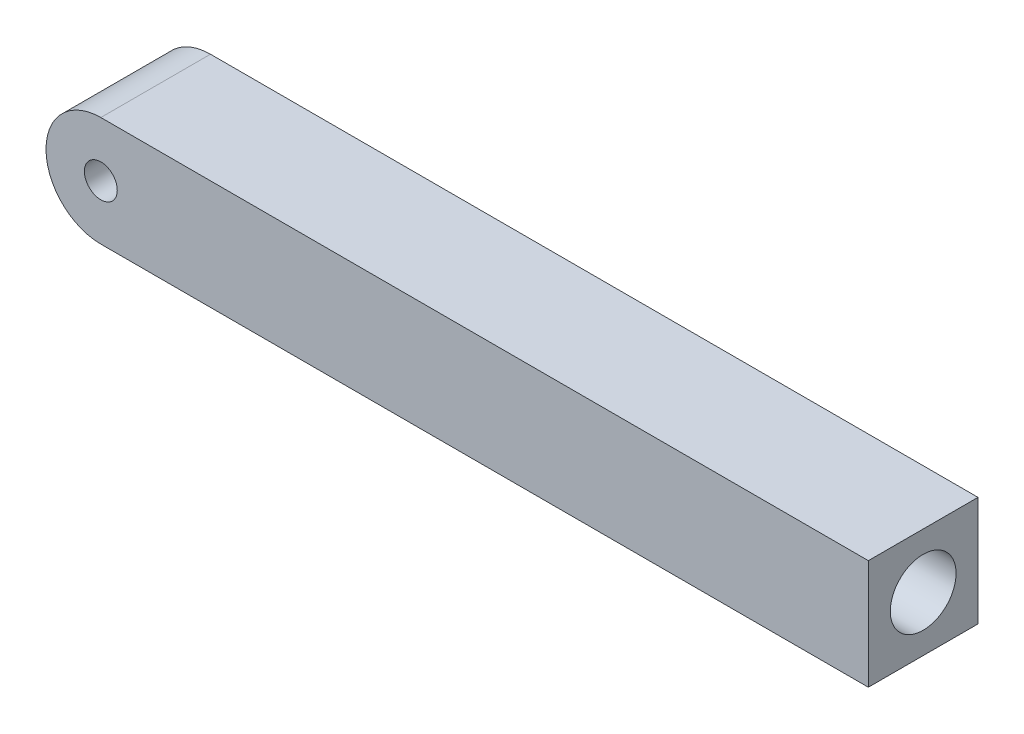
ISO-10303-21;
HEADER;
FILE_DESCRIPTION(('STEP AP214'),'2;1');
FILE_NAME('part.step','',(''),(''),'','','');
FILE_SCHEMA(('AUTOMOTIVE_DESIGN { 1 0 10303 214 1 1 1 1 }'));
ENDSEC;
DATA;
#1=APPLICATION_CONTEXT('core data for automotive mechanical design processes');
#2=APPLICATION_PROTOCOL_DEFINITION('international standard','automotive_design',2000,#1);
#3=PRODUCT_CONTEXT('',#1,'mechanical');
#4=PRODUCT('Part','Part','',(#3));
#5=PRODUCT_RELATED_PRODUCT_CATEGORY('part','',(#4));
#6=PRODUCT_DEFINITION_FORMATION('','',#4);
#7=PRODUCT_DEFINITION_CONTEXT('part definition',#1,'design');
#8=PRODUCT_DEFINITION('design','',#6,#7);
#9=PRODUCT_DEFINITION_SHAPE('','',#8);
#10=(LENGTH_UNIT() NAMED_UNIT(*) SI_UNIT(.MILLI.,.METRE.));
#11=(NAMED_UNIT(*) PLANE_ANGLE_UNIT() SI_UNIT($,.RADIAN.));
#12=(NAMED_UNIT(*) SI_UNIT($,.STERADIAN.) SOLID_ANGLE_UNIT());
#13=UNCERTAINTY_MEASURE_WITH_UNIT(LENGTH_MEASURE(1.E-05),#10,'distance_accuracy_value','');
#14=(GEOMETRIC_REPRESENTATION_CONTEXT(3) GLOBAL_UNCERTAINTY_ASSIGNED_CONTEXT((#13)) GLOBAL_UNIT_ASSIGNED_CONTEXT((#10,
#11,#12)) REPRESENTATION_CONTEXT('',''));
#15=CARTESIAN_POINT('',(0.,0.,0.));
#16=DIRECTION('',(0.,0.,1.));
#17=DIRECTION('',(1.,0.,0.));
#18=AXIS2_PLACEMENT_3D('',#15,#16,#17);
#19=CARTESIAN_POINT('',(0.,0.,5.));
#20=DIRECTION('',(0.,0.,1.));
#21=DIRECTION('',(1.,0.,0.));
#22=AXIS2_PLACEMENT_3D('',#19,#20,#21);
#23=PLANE('',#22);
#24=DIRECTION('',(0.,1.,0.));
#25=VECTOR('',#24,1.);
#26=CARTESIAN_POINT('',(35.,2.5,5.));
#27=LINE('',#26,#25);
#28=CARTESIAN_POINT('',(35.,-2.5,5.));
#29=VERTEX_POINT('',#28);
#30=CARTESIAN_POINT('',(35.,2.5,5.));
#31=VERTEX_POINT('',#30);
#32=EDGE_CURVE('E100',#29,#31,#27,.T.);
#33=ORIENTED_EDGE('',*,*,#32,.T.);
#34=DIRECTION('',(-1.,0.,0.));
#35=VECTOR('',#34,1.);
#36=CARTESIAN_POINT('',(0.,2.5,5.));
#37=LINE('',#36,#35);
#38=CARTESIAN_POINT('',(0.,2.5,5.));
#39=VERTEX_POINT('',#38);
#40=EDGE_CURVE('E85',#31,#39,#37,.T.);
#41=ORIENTED_EDGE('',*,*,#40,.T.);
#42=CARTESIAN_POINT('',(0.,0.,5.));
#43=DIRECTION('',(0.,0.,1.));
#44=DIRECTION('',(1.,0.,0.));
#45=AXIS2_PLACEMENT_3D('',#42,#43,#44);
#46=CIRCLE('',#45,2.5);
#47=CARTESIAN_POINT('',(0.,-2.5,5.));
#48=VERTEX_POINT('',#47);
#49=EDGE_CURVE('E51',#39,#48,#46,.T.);
#50=ORIENTED_EDGE('',*,*,#49,.T.);
#51=DIRECTION('',(1.,0.,0.));
#52=VECTOR('',#51,1.);
#53=CARTESIAN_POINT('',(0.,-2.5,5.));
#54=LINE('',#53,#52);
#55=EDGE_CURVE('E46',#48,#29,#54,.T.);
#56=ORIENTED_EDGE('',*,*,#55,.T.);
#57=EDGE_LOOP('',(#33,#41,#50,#56));
#58=FACE_BOUND('',#57,.T.);
#59=CARTESIAN_POINT('',(0.,0.,5.));
#60=DIRECTION('',(0.,0.,1.));
#61=DIRECTION('',(1.,0.,0.));
#62=AXIS2_PLACEMENT_3D('',#59,#60,#61);
#63=CIRCLE('',#62,0.75);
#64=CARTESIAN_POINT('',(0.75,0.,5.));
#65=VERTEX_POINT('',#64);
#66=EDGE_CURVE('E90',#65,#65,#63,.T.);
#67=ORIENTED_EDGE('',*,*,#66,.F.);
#68=EDGE_LOOP('',(#67));
#69=FACE_BOUND('',#68,.T.);
#70=ADVANCED_FACE('F31',(#58,#69),#23,.T.);
#71=CARTESIAN_POINT('',(0.,0.,0.));
#72=DIRECTION('',(0.,0.,1.));
#73=DIRECTION('',(1.,0.,0.));
#74=AXIS2_PLACEMENT_3D('',#71,#72,#73);
#75=PLANE('',#74);
#76=DIRECTION('',(0.,1.,0.));
#77=VECTOR('',#76,1.);
#78=CARTESIAN_POINT('',(35.,2.5,0.));
#79=LINE('',#78,#77);
#80=CARTESIAN_POINT('',(35.,-2.5,0.));
#81=VERTEX_POINT('',#80);
#82=CARTESIAN_POINT('',(35.,2.5,0.));
#83=VERTEX_POINT('',#82);
#84=EDGE_CURVE('E77',#81,#83,#79,.T.);
#85=ORIENTED_EDGE('',*,*,#84,.F.);
#86=DIRECTION('',(1.,0.,0.));
#87=VECTOR('',#86,1.);
#88=CARTESIAN_POINT('',(0.,-2.5,0.));
#89=LINE('',#88,#87);
#90=CARTESIAN_POINT('',(0.,-2.5,0.));
#91=VERTEX_POINT('',#90);
#92=EDGE_CURVE('E98',#91,#81,#89,.T.);
#93=ORIENTED_EDGE('',*,*,#92,.F.);
#94=CARTESIAN_POINT('',(0.,0.,0.));
#95=DIRECTION('',(0.,0.,1.));
#96=DIRECTION('',(1.,0.,0.));
#97=AXIS2_PLACEMENT_3D('',#94,#95,#96);
#98=CIRCLE('',#97,2.5);
#99=CARTESIAN_POINT('',(0.,2.5,0.));
#100=VERTEX_POINT('',#99);
#101=EDGE_CURVE('E78',#100,#91,#98,.T.);
#102=ORIENTED_EDGE('',*,*,#101,.F.);
#103=DIRECTION('',(-1.,0.,0.));
#104=VECTOR('',#103,1.);
#105=CARTESIAN_POINT('',(0.,2.5,0.));
#106=LINE('',#105,#104);
#107=EDGE_CURVE('E72',#83,#100,#106,.T.);
#108=ORIENTED_EDGE('',*,*,#107,.F.);
#109=EDGE_LOOP('',(#85,#93,#102,#108));
#110=FACE_BOUND('',#109,.T.);
#111=CARTESIAN_POINT('',(0.,0.,0.));
#112=DIRECTION('',(0.,0.,1.));
#113=DIRECTION('',(1.,0.,0.));
#114=AXIS2_PLACEMENT_3D('',#111,#112,#113);
#115=CIRCLE('',#114,0.75);
#116=CARTESIAN_POINT('',(0.75,0.,0.));
#117=VERTEX_POINT('',#116);
#118=EDGE_CURVE('E93',#117,#117,#115,.T.);
#119=ORIENTED_EDGE('',*,*,#118,.T.);
#120=EDGE_LOOP('',(#119));
#121=FACE_BOUND('',#120,.T.);
#122=ADVANCED_FACE('F73',(#110,#121),#75,.F.);
#123=CARTESIAN_POINT('',(35.,2.5,5.));
#124=DIRECTION('',(-1.,0.,0.));
#125=DIRECTION('',(0.,-1.,0.));
#126=AXIS2_PLACEMENT_3D('',#123,#124,#125);
#127=PLANE('',#126);
#128=CARTESIAN_POINT('',(35.,0.,2.5));
#129=DIRECTION('',(1.,0.,0.));
#130=DIRECTION('',(0.,1.,0.));
#131=AXIS2_PLACEMENT_3D('',#128,#129,#130);
#132=CIRCLE('',#131,1.5);
#133=CARTESIAN_POINT('',(35.,1.5000000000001,2.5));
#134=VERTEX_POINT('',#133);
#135=EDGE_CURVE('E126',#134,#134,#132,.T.);
#136=ORIENTED_EDGE('',*,*,#135,.F.);
#137=EDGE_LOOP('',(#136));
#138=FACE_BOUND('',#137,.T.);
#139=ORIENTED_EDGE('',*,*,#84,.T.);
#140=DIRECTION('',(0.,0.,-1.));
#141=VECTOR('',#140,1.);
#142=CARTESIAN_POINT('',(35.,2.5,5.));
#143=LINE('',#142,#141);
#144=EDGE_CURVE('E11',#31,#83,#143,.T.);
#145=ORIENTED_EDGE('',*,*,#144,.F.);
#146=ORIENTED_EDGE('',*,*,#32,.F.);
#147=DIRECTION('',(0.,0.,-1.));
#148=VECTOR('',#147,1.);
#149=CARTESIAN_POINT('',(35.,-2.5,5.));
#150=LINE('',#149,#148);
#151=EDGE_CURVE('E89',#29,#81,#150,.T.);
#152=ORIENTED_EDGE('',*,*,#151,.T.);
#153=EDGE_LOOP('',(#139,#145,#146,#152));
#154=FACE_BOUND('',#153,.T.);
#155=ADVANCED_FACE('F33',(#138,#154),#127,.F.);
#156=CARTESIAN_POINT('',(0.,2.5,5.));
#157=DIRECTION('',(0.,-1.,0.));
#158=DIRECTION('',(0.,0.,-1.));
#159=AXIS2_PLACEMENT_3D('',#156,#157,#158);
#160=PLANE('',#159);
#161=ORIENTED_EDGE('',*,*,#107,.T.);
#162=DIRECTION('',(0.,0.,-1.));
#163=VECTOR('',#162,1.);
#164=CARTESIAN_POINT('',(0.,2.5,5.));
#165=LINE('',#164,#163);
#166=EDGE_CURVE('E39',#39,#100,#165,.T.);
#167=ORIENTED_EDGE('',*,*,#166,.F.);
#168=ORIENTED_EDGE('',*,*,#40,.F.);
#169=ORIENTED_EDGE('',*,*,#144,.T.);
#170=EDGE_LOOP('',(#161,#167,#168,#169));
#171=FACE_BOUND('',#170,.T.);
#172=ADVANCED_FACE('F84',(#171),#160,.F.);
#173=CARTESIAN_POINT('',(0.,0.,5.));
#174=DIRECTION('',(0.,0.,-1.));
#175=DIRECTION('',(-1.,0.,0.));
#176=AXIS2_PLACEMENT_3D('',#173,#174,#175);
#177=CYLINDRICAL_SURFACE('',#176,2.5);
#178=ORIENTED_EDGE('',*,*,#101,.T.);
#179=DIRECTION('',(0.,0.,-1.));
#180=VECTOR('',#179,1.);
#181=CARTESIAN_POINT('',(0.,-2.5,5.));
#182=LINE('',#181,#180);
#183=EDGE_CURVE('E106',#48,#91,#182,.T.);
#184=ORIENTED_EDGE('',*,*,#183,.F.);
#185=ORIENTED_EDGE('',*,*,#49,.F.);
#186=ORIENTED_EDGE('',*,*,#166,.T.);
#187=EDGE_LOOP('',(#178,#184,#185,#186));
#188=FACE_BOUND('',#187,.T.);
#189=ADVANCED_FACE('F109',(#188),#177,.T.);
#190=CARTESIAN_POINT('',(0.,-2.5,5.));
#191=DIRECTION('',(0.,1.,0.));
#192=DIRECTION('',(0.,0.,1.));
#193=AXIS2_PLACEMENT_3D('',#190,#191,#192);
#194=PLANE('',#193);
#195=ORIENTED_EDGE('',*,*,#92,.T.);
#196=ORIENTED_EDGE('',*,*,#151,.F.);
#197=ORIENTED_EDGE('',*,*,#55,.F.);
#198=ORIENTED_EDGE('',*,*,#183,.T.);
#199=EDGE_LOOP('',(#195,#196,#197,#198));
#200=FACE_BOUND('',#199,.T.);
#201=ADVANCED_FACE('F111',(#200),#194,.F.);
#202=CARTESIAN_POINT('',(0.,0.,5.));
#203=DIRECTION('',(0.,0.,-1.));
#204=DIRECTION('',(-1.,0.,0.));
#205=AXIS2_PLACEMENT_3D('',#202,#203,#204);
#206=CYLINDRICAL_SURFACE('',#205,0.75);
#207=ORIENTED_EDGE('',*,*,#66,.T.);
#208=EDGE_LOOP('',(#207));
#209=FACE_BOUND('',#208,.T.);
#210=ORIENTED_EDGE('',*,*,#118,.F.);
#211=EDGE_LOOP('',(#210));
#212=FACE_BOUND('',#211,.T.);
#213=ADVANCED_FACE('F117',(#209,#212),#206,.F.);
#214=CARTESIAN_POINT('',(15.,0.,2.5));
#215=DIRECTION('',(1.,0.,0.));
#216=DIRECTION('',(0.,1.,0.));
#217=AXIS2_PLACEMENT_3D('',#214,#215,#216);
#218=CYLINDRICAL_SURFACE('',#217,1.5);
#219=CARTESIAN_POINT('',(15.,0.,2.5));
#220=DIRECTION('',(1.,0.,0.));
#221=DIRECTION('',(0.,1.,0.));
#222=AXIS2_PLACEMENT_3D('',#219,#220,#221);
#223=CIRCLE('',#222,1.5);
#224=CARTESIAN_POINT('',(15.,1.50000000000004,2.5));
#225=VERTEX_POINT('',#224);
#226=EDGE_CURVE('E124',#225,#225,#223,.T.);
#227=ORIENTED_EDGE('',*,*,#226,.F.);
#228=EDGE_LOOP('',(#227));
#229=FACE_BOUND('',#228,.T.);
#230=ORIENTED_EDGE('',*,*,#135,.T.);
#231=EDGE_LOOP('',(#230));
#232=FACE_BOUND('',#231,.T.);
#233=ADVANCED_FACE('F120',(#229,#232),#218,.F.);
#234=CARTESIAN_POINT('',(15.,0.,2.5));
#235=DIRECTION('',(1.,0.,0.));
#236=DIRECTION('',(0.,1.,0.));
#237=AXIS2_PLACEMENT_3D('',#234,#235,#236);
#238=PLANE('',#237);
#239=ORIENTED_EDGE('',*,*,#226,.T.);
#240=EDGE_LOOP('',(#239));
#241=FACE_BOUND('',#240,.T.);
#242=ADVANCED_FACE('F164',(#241),#238,.T.);
#243=CLOSED_SHELL('',(#70,#122,#155,#172,#189,#201,#213,#233,#242));
#244=MANIFOLD_SOLID_BREP('B2',#243);
#245=ADVANCED_BREP_SHAPE_REPRESENTATION('',(#18,#244),#14);
#246=SHAPE_DEFINITION_REPRESENTATION(#9,#245);
ENDSEC;
END-ISO-10303-21;
